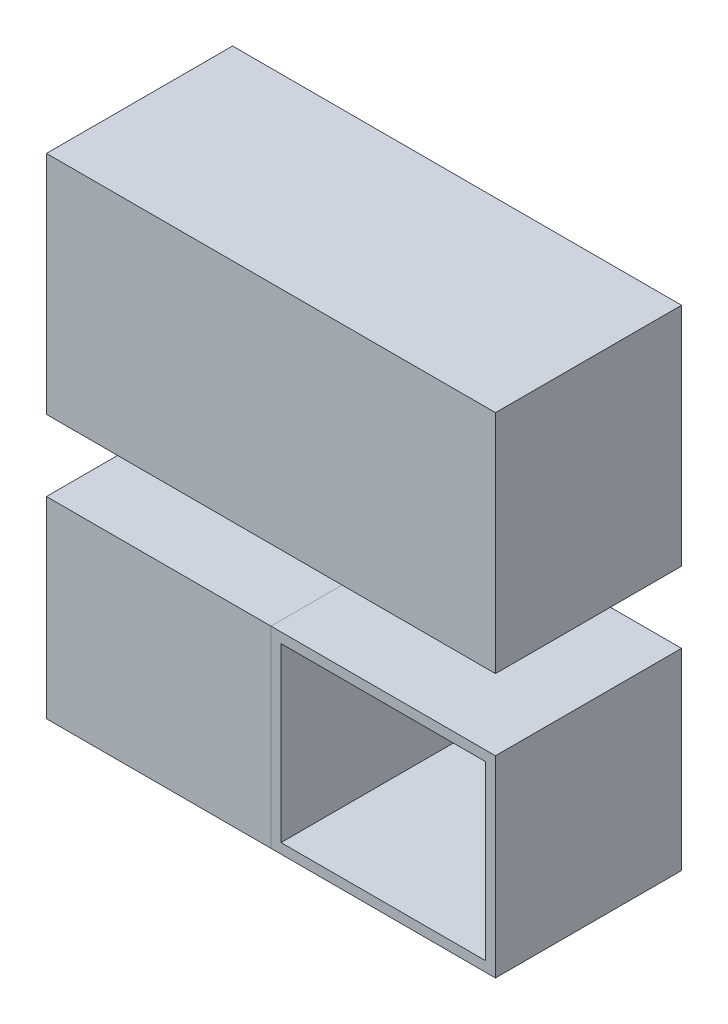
ISO-10303-21;
HEADER;
FILE_DESCRIPTION(('STEP AP214'),'2;1');
FILE_NAME('part.step','',(''),(''),'','','');
FILE_SCHEMA(('AUTOMOTIVE_DESIGN { 1 0 10303 214 1 1 1 1 }'));
ENDSEC;
DATA;
#1=APPLICATION_CONTEXT('core data for automotive mechanical design processes');
#2=APPLICATION_PROTOCOL_DEFINITION('international standard','automotive_design',2000,#1);
#3=PRODUCT_CONTEXT('',#1,'mechanical');
#4=PRODUCT('Part','Part','',(#3));
#5=PRODUCT_RELATED_PRODUCT_CATEGORY('part','',(#4));
#6=PRODUCT_DEFINITION_FORMATION('','',#4);
#7=PRODUCT_DEFINITION_CONTEXT('part definition',#1,'design');
#8=PRODUCT_DEFINITION('design','',#6,#7);
#9=PRODUCT_DEFINITION_SHAPE('','',#8);
#10=(LENGTH_UNIT() NAMED_UNIT(*) SI_UNIT(.MILLI.,.METRE.));
#11=(NAMED_UNIT(*) PLANE_ANGLE_UNIT() SI_UNIT($,.RADIAN.));
#12=(NAMED_UNIT(*) SI_UNIT($,.STERADIAN.) SOLID_ANGLE_UNIT());
#13=UNCERTAINTY_MEASURE_WITH_UNIT(LENGTH_MEASURE(1.E-05),#10,'distance_accuracy_value','');
#14=(GEOMETRIC_REPRESENTATION_CONTEXT(3) GLOBAL_UNCERTAINTY_ASSIGNED_CONTEXT((#13)) GLOBAL_UNIT_ASSIGNED_CONTEXT((#10,
#11,#12)) REPRESENTATION_CONTEXT('',''));
#15=CARTESIAN_POINT('',(0.,0.,0.));
#16=DIRECTION('',(0.,0.,1.));
#17=DIRECTION('',(1.,0.,0.));
#18=AXIS2_PLACEMENT_3D('',#15,#16,#17);
#19=CARTESIAN_POINT('',(56.7002958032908,-17.9628969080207,0.));
#20=DIRECTION('',(0.,0.,-1.));
#21=DIRECTION('',(-1.,0.,0.));
#22=AXIS2_PLACEMENT_3D('',#19,#20,#21);
#23=PLANE('',#22);
#24=DIRECTION('',(0.,-1.,0.));
#25=VECTOR('',#24,1.);
#26=CARTESIAN_POINT('',(56.7002958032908,-66.5730790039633,0.));
#27=LINE('',#26,#25);
#28=CARTESIAN_POINT('',(56.7002958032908,-17.9628969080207,0.));
#29=VERTEX_POINT('',#28);
#30=CARTESIAN_POINT('',(56.7002958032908,-66.5730790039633,0.));
#31=VERTEX_POINT('',#30);
#32=EDGE_CURVE('E114',#29,#31,#27,.T.);
#33=ORIENTED_EDGE('',*,*,#32,.T.);
#34=DIRECTION('',(1.,0.,0.));
#35=VECTOR('',#34,1.);
#36=CARTESIAN_POINT('',(56.7002958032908,-66.5730790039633,0.));
#37=LINE('',#36,#35);
#38=CARTESIAN_POINT('',(113.400591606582,-66.5730790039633,0.));
#39=VERTEX_POINT('',#38);
#40=EDGE_CURVE('E147',#31,#39,#37,.T.);
#41=ORIENTED_EDGE('',*,*,#40,.T.);
#42=DIRECTION('',(0.,1.,0.));
#43=VECTOR('',#42,1.);
#44=CARTESIAN_POINT('',(113.400591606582,-66.5730790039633,0.));
#45=LINE('',#44,#43);
#46=CARTESIAN_POINT('',(113.400591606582,-17.9628969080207,0.));
#47=VERTEX_POINT('',#46);
#48=EDGE_CURVE('E150',#39,#47,#45,.T.);
#49=ORIENTED_EDGE('',*,*,#48,.T.);
#50=DIRECTION('',(-1.,0.,0.));
#51=VECTOR('',#50,1.);
#52=CARTESIAN_POINT('',(56.7002958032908,-17.9628969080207,0.));
#53=LINE('',#52,#51);
#54=EDGE_CURVE('E153',#47,#29,#53,.T.);
#55=ORIENTED_EDGE('',*,*,#54,.T.);
#56=EDGE_LOOP('',(#33,#41,#49,#55));
#57=FACE_BOUND('',#56,.T.);
#58=DIRECTION('',(0.,-1.,0.));
#59=VECTOR('',#58,1.);
#60=CARTESIAN_POINT('',(59.2402958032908,-66.5730790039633,0.));
#61=LINE('',#60,#59);
#62=CARTESIAN_POINT('',(59.2402958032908,-20.5028969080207,0.));
#63=VERTEX_POINT('',#62);
#64=CARTESIAN_POINT('',(59.2402958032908,-64.0330790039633,0.));
#65=VERTEX_POINT('',#64);
#66=EDGE_CURVE('E138',#63,#65,#61,.T.);
#67=ORIENTED_EDGE('',*,*,#66,.F.);
#68=DIRECTION('',(-1.,0.,0.));
#69=VECTOR('',#68,1.);
#70=CARTESIAN_POINT('',(56.7002958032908,-20.5028969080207,0.));
#71=LINE('',#70,#69);
#72=CARTESIAN_POINT('',(110.860591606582,-20.5028969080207,0.));
#73=VERTEX_POINT('',#72);
#74=EDGE_CURVE('E110',#73,#63,#71,.T.);
#75=ORIENTED_EDGE('',*,*,#74,.F.);
#76=DIRECTION('',(0.,1.,0.));
#77=VECTOR('',#76,1.);
#78=CARTESIAN_POINT('',(110.860591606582,-66.5730790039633,0.));
#79=LINE('',#78,#77);
#80=CARTESIAN_POINT('',(110.860591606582,-64.0330790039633,0.));
#81=VERTEX_POINT('',#80);
#82=EDGE_CURVE('E55',#81,#73,#79,.T.);
#83=ORIENTED_EDGE('',*,*,#82,.F.);
#84=DIRECTION('',(1.,0.,0.));
#85=VECTOR('',#84,1.);
#86=CARTESIAN_POINT('',(56.7002958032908,-64.0330790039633,0.));
#87=LINE('',#86,#85);
#88=EDGE_CURVE('E140',#65,#81,#87,.T.);
#89=ORIENTED_EDGE('',*,*,#88,.F.);
#90=EDGE_LOOP('',(#67,#75,#83,#89));
#91=FACE_BOUND('',#90,.T.);
#92=ADVANCED_FACE('F38',(#57,#91),#23,.F.);
#93=CARTESIAN_POINT('',(56.7002958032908,-66.5730790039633,-46.99));
#94=DIRECTION('',(-1.,0.,0.));
#95=DIRECTION('',(0.,0.,1.));
#96=AXIS2_PLACEMENT_3D('',#93,#94,#95);
#97=PLANE('',#96);
#98=ORIENTED_EDGE('',*,*,#32,.F.);
#99=DIRECTION('',(0.,0.,1.));
#100=VECTOR('',#99,1.);
#101=CARTESIAN_POINT('',(56.7002958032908,-17.9628969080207,-46.99));
#102=LINE('',#101,#100);
#103=CARTESIAN_POINT('',(56.7002958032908,-17.9628969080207,-46.99));
#104=VERTEX_POINT('',#103);
#105=EDGE_CURVE('E12',#104,#29,#102,.T.);
#106=ORIENTED_EDGE('',*,*,#105,.F.);
#107=DIRECTION('',(0.,-1.,0.));
#108=VECTOR('',#107,1.);
#109=CARTESIAN_POINT('',(56.7002958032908,-66.5730790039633,-46.99));
#110=LINE('',#109,#108);
#111=CARTESIAN_POINT('',(56.7002958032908,-66.5730790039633,-46.99));
#112=VERTEX_POINT('',#111);
#113=EDGE_CURVE('E156',#104,#112,#110,.T.);
#114=ORIENTED_EDGE('',*,*,#113,.T.);
#115=DIRECTION('',(0.,0.,1.));
#116=VECTOR('',#115,1.);
#117=CARTESIAN_POINT('',(56.7002958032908,-66.5730790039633,-46.99));
#118=LINE('',#117,#116);
#119=EDGE_CURVE('E42',#112,#31,#118,.T.);
#120=ORIENTED_EDGE('',*,*,#119,.T.);
#121=EDGE_LOOP('',(#98,#106,#114,#120));
#122=FACE_BOUND('',#121,.T.);
#123=ADVANCED_FACE('F40',(#122),#97,.T.);
#124=CARTESIAN_POINT('',(56.7002958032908,-17.9628969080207,-46.99));
#125=DIRECTION('',(0.,1.,0.));
#126=DIRECTION('',(0.,0.,1.));
#127=AXIS2_PLACEMENT_3D('',#124,#125,#126);
#128=PLANE('',#127);
#129=ORIENTED_EDGE('',*,*,#54,.F.);
#130=DIRECTION('',(0.,0.,1.));
#131=VECTOR('',#130,1.);
#132=CARTESIAN_POINT('',(113.400591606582,-17.9628969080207,-46.99));
#133=LINE('',#132,#131);
#134=CARTESIAN_POINT('',(113.400591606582,-17.9628969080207,-46.99));
#135=VERTEX_POINT('',#134);
#136=EDGE_CURVE('E47',#135,#47,#133,.T.);
#137=ORIENTED_EDGE('',*,*,#136,.F.);
#138=DIRECTION('',(-1.,0.,0.));
#139=VECTOR('',#138,1.);
#140=CARTESIAN_POINT('',(56.7002958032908,-17.9628969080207,-46.99));
#141=LINE('',#140,#139);
#142=EDGE_CURVE('E164',#135,#104,#141,.T.);
#143=ORIENTED_EDGE('',*,*,#142,.T.);
#144=ORIENTED_EDGE('',*,*,#105,.T.);
#145=EDGE_LOOP('',(#129,#137,#143,#144));
#146=FACE_BOUND('',#145,.T.);
#147=ADVANCED_FACE('F177',(#146),#128,.T.);
#148=CARTESIAN_POINT('',(113.400591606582,-66.5730790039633,-46.99));
#149=DIRECTION('',(1.,0.,0.));
#150=DIRECTION('',(0.,0.,-1.));
#151=AXIS2_PLACEMENT_3D('',#148,#149,#150);
#152=PLANE('',#151);
#153=ORIENTED_EDGE('',*,*,#48,.F.);
#154=DIRECTION('',(0.,0.,1.));
#155=VECTOR('',#154,1.);
#156=CARTESIAN_POINT('',(113.400591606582,-66.5730790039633,-46.99));
#157=LINE('',#156,#155);
#158=CARTESIAN_POINT('',(113.400591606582,-66.5730790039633,-46.99));
#159=VERTEX_POINT('',#158);
#160=EDGE_CURVE('E167',#159,#39,#157,.T.);
#161=ORIENTED_EDGE('',*,*,#160,.F.);
#162=DIRECTION('',(0.,1.,0.));
#163=VECTOR('',#162,1.);
#164=CARTESIAN_POINT('',(113.400591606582,-66.5730790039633,-46.99));
#165=LINE('',#164,#163);
#166=EDGE_CURVE('E161',#159,#135,#165,.T.);
#167=ORIENTED_EDGE('',*,*,#166,.T.);
#168=ORIENTED_EDGE('',*,*,#136,.T.);
#169=EDGE_LOOP('',(#153,#161,#167,#168));
#170=FACE_BOUND('',#169,.T.);
#171=ADVANCED_FACE('F183',(#170),#152,.T.);
#172=CARTESIAN_POINT('',(56.7002958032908,-66.5730790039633,-46.99));
#173=DIRECTION('',(0.,-1.,0.));
#174=DIRECTION('',(0.,0.,-1.));
#175=AXIS2_PLACEMENT_3D('',#172,#173,#174);
#176=PLANE('',#175);
#177=ORIENTED_EDGE('',*,*,#40,.F.);
#178=ORIENTED_EDGE('',*,*,#119,.F.);
#179=DIRECTION('',(1.,0.,0.));
#180=VECTOR('',#179,1.);
#181=CARTESIAN_POINT('',(56.7002958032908,-66.5730790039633,-46.99));
#182=LINE('',#181,#180);
#183=EDGE_CURVE('E158',#112,#159,#182,.T.);
#184=ORIENTED_EDGE('',*,*,#183,.T.);
#185=ORIENTED_EDGE('',*,*,#160,.T.);
#186=EDGE_LOOP('',(#177,#178,#184,#185));
#187=FACE_BOUND('',#186,.T.);
#188=ADVANCED_FACE('F172',(#187),#176,.T.);
#189=CARTESIAN_POINT('',(56.7002958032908,-17.9628969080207,-46.99));
#190=DIRECTION('',(0.,0.,-1.));
#191=DIRECTION('',(-1.,0.,0.));
#192=AXIS2_PLACEMENT_3D('',#189,#190,#191);
#193=PLANE('',#192);
#194=ORIENTED_EDGE('',*,*,#113,.F.);
#195=ORIENTED_EDGE('',*,*,#142,.F.);
#196=ORIENTED_EDGE('',*,*,#166,.F.);
#197=ORIENTED_EDGE('',*,*,#183,.F.);
#198=EDGE_LOOP('',(#194,#195,#196,#197));
#199=FACE_BOUND('',#198,.T.);
#200=ADVANCED_FACE('F181',(#199),#193,.T.);
#201=CARTESIAN_POINT('',(59.2402958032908,-66.5730790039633,-46.99));
#202=DIRECTION('',(-1.,0.,0.));
#203=DIRECTION('',(0.,0.,1.));
#204=AXIS2_PLACEMENT_3D('',#201,#202,#203);
#205=PLANE('',#204);
#206=ORIENTED_EDGE('',*,*,#66,.T.);
#207=DIRECTION('',(0.,0.,1.));
#208=VECTOR('',#207,1.);
#209=CARTESIAN_POINT('',(59.2402958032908,-64.0330790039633,-46.99));
#210=LINE('',#209,#208);
#211=CARTESIAN_POINT('',(59.2402958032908,-64.0330790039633,-44.45));
#212=VERTEX_POINT('',#211);
#213=EDGE_CURVE('E120',#212,#65,#210,.T.);
#214=ORIENTED_EDGE('',*,*,#213,.F.);
#215=DIRECTION('',(0.,-1.,0.));
#216=VECTOR('',#215,1.);
#217=CARTESIAN_POINT('',(59.2402958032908,-66.5730790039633,-44.45));
#218=LINE('',#217,#216);
#219=CARTESIAN_POINT('',(59.2402958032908,-20.5028969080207,-44.45));
#220=VERTEX_POINT('',#219);
#221=EDGE_CURVE('E118',#220,#212,#218,.T.);
#222=ORIENTED_EDGE('',*,*,#221,.F.);
#223=DIRECTION('',(0.,0.,1.));
#224=VECTOR('',#223,1.);
#225=CARTESIAN_POINT('',(59.2402958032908,-20.5028969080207,-46.99));
#226=LINE('',#225,#224);
#227=EDGE_CURVE('E104',#220,#63,#226,.T.);
#228=ORIENTED_EDGE('',*,*,#227,.T.);
#229=EDGE_LOOP('',(#206,#214,#222,#228));
#230=FACE_BOUND('',#229,.T.);
#231=ADVANCED_FACE('F119',(#230),#205,.F.);
#232=CARTESIAN_POINT('',(56.7002958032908,-20.5028969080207,-46.99));
#233=DIRECTION('',(0.,1.,0.));
#234=DIRECTION('',(0.,0.,1.));
#235=AXIS2_PLACEMENT_3D('',#232,#233,#234);
#236=PLANE('',#235);
#237=ORIENTED_EDGE('',*,*,#74,.T.);
#238=ORIENTED_EDGE('',*,*,#227,.F.);
#239=DIRECTION('',(-1.,0.,0.));
#240=VECTOR('',#239,1.);
#241=CARTESIAN_POINT('',(56.7002958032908,-20.5028969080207,-44.45));
#242=LINE('',#241,#240);
#243=CARTESIAN_POINT('',(110.860591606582,-20.5028969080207,-44.45));
#244=VERTEX_POINT('',#243);
#245=EDGE_CURVE('E108',#244,#220,#242,.T.);
#246=ORIENTED_EDGE('',*,*,#245,.F.);
#247=DIRECTION('',(0.,0.,1.));
#248=VECTOR('',#247,1.);
#249=CARTESIAN_POINT('',(110.860591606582,-20.5028969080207,-46.99));
#250=LINE('',#249,#248);
#251=EDGE_CURVE('E115',#244,#73,#250,.T.);
#252=ORIENTED_EDGE('',*,*,#251,.T.);
#253=EDGE_LOOP('',(#237,#238,#246,#252));
#254=FACE_BOUND('',#253,.T.);
#255=ADVANCED_FACE('F106',(#254),#236,.F.);
#256=CARTESIAN_POINT('',(110.860591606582,-66.5730790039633,-46.99));
#257=DIRECTION('',(1.,0.,0.));
#258=DIRECTION('',(0.,0.,-1.));
#259=AXIS2_PLACEMENT_3D('',#256,#257,#258);
#260=PLANE('',#259);
#261=ORIENTED_EDGE('',*,*,#82,.T.);
#262=ORIENTED_EDGE('',*,*,#251,.F.);
#263=DIRECTION('',(0.,1.,0.));
#264=VECTOR('',#263,1.);
#265=CARTESIAN_POINT('',(110.860591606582,-66.5730790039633,-44.45));
#266=LINE('',#265,#264);
#267=CARTESIAN_POINT('',(110.860591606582,-64.0330790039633,-44.45));
#268=VERTEX_POINT('',#267);
#269=EDGE_CURVE('E129',#268,#244,#266,.T.);
#270=ORIENTED_EDGE('',*,*,#269,.F.);
#271=DIRECTION('',(0.,0.,1.));
#272=VECTOR('',#271,1.);
#273=CARTESIAN_POINT('',(110.860591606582,-64.0330790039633,-46.99));
#274=LINE('',#273,#272);
#275=EDGE_CURVE('E131',#268,#81,#274,.T.);
#276=ORIENTED_EDGE('',*,*,#275,.T.);
#277=EDGE_LOOP('',(#261,#262,#270,#276));
#278=FACE_BOUND('',#277,.T.);
#279=ADVANCED_FACE('F207',(#278),#260,.F.);
#280=CARTESIAN_POINT('',(56.7002958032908,-64.0330790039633,-46.99));
#281=DIRECTION('',(0.,-1.,0.));
#282=DIRECTION('',(0.,0.,-1.));
#283=AXIS2_PLACEMENT_3D('',#280,#281,#282);
#284=PLANE('',#283);
#285=ORIENTED_EDGE('',*,*,#88,.T.);
#286=ORIENTED_EDGE('',*,*,#275,.F.);
#287=DIRECTION('',(1.,0.,0.));
#288=VECTOR('',#287,1.);
#289=CARTESIAN_POINT('',(56.7002958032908,-64.0330790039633,-44.45));
#290=LINE('',#289,#288);
#291=EDGE_CURVE('E124',#212,#268,#290,.T.);
#292=ORIENTED_EDGE('',*,*,#291,.F.);
#293=ORIENTED_EDGE('',*,*,#213,.T.);
#294=EDGE_LOOP('',(#285,#286,#292,#293));
#295=FACE_BOUND('',#294,.T.);
#296=ADVANCED_FACE('F211',(#295),#284,.F.);
#297=CARTESIAN_POINT('',(56.7002958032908,-17.9628969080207,-44.45));
#298=DIRECTION('',(0.,0.,-1.));
#299=DIRECTION('',(-1.,0.,0.));
#300=AXIS2_PLACEMENT_3D('',#297,#298,#299);
#301=PLANE('',#300);
#302=ORIENTED_EDGE('',*,*,#221,.T.);
#303=ORIENTED_EDGE('',*,*,#291,.T.);
#304=ORIENTED_EDGE('',*,*,#269,.T.);
#305=ORIENTED_EDGE('',*,*,#245,.T.);
#306=EDGE_LOOP('',(#302,#303,#304,#305));
#307=FACE_BOUND('',#306,.T.);
#308=ADVANCED_FACE('F127',(#307),#301,.F.);
#309=CLOSED_SHELL('',(#92,#123,#147,#171,#188,#200,#231,#255,#279,#296,#308));
#310=MANIFOLD_SOLID_BREP('B2',#309);
#311=CARTESIAN_POINT('',(0.,-17.9628969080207,-46.99));
#312=DIRECTION('',(-1.,0.,0.));
#313=DIRECTION('',(0.,0.,1.));
#314=AXIS2_PLACEMENT_3D('',#311,#312,#313);
#315=PLANE('',#314);
#316=DIRECTION('',(0.,-1.,0.));
#317=VECTOR('',#316,1.);
#318=CARTESIAN_POINT('',(0.,-17.9628969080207,0.));
#319=LINE('',#318,#317);
#320=CARTESIAN_POINT('',(0.,-17.9628969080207,0.));
#321=VERTEX_POINT('',#320);
#322=CARTESIAN_POINT('',(0.,-66.5730790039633,0.));
#323=VERTEX_POINT('',#322);
#324=EDGE_CURVE('E303',#321,#323,#319,.T.);
#325=ORIENTED_EDGE('',*,*,#324,.F.);
#326=DIRECTION('',(0.,0.,1.));
#327=VECTOR('',#326,1.);
#328=CARTESIAN_POINT('',(0.,-17.9628969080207,-46.99));
#329=LINE('',#328,#327);
#330=CARTESIAN_POINT('',(0.,-17.9628969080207,-46.99));
#331=VERTEX_POINT('',#330);
#332=EDGE_CURVE('E36',#331,#321,#329,.T.);
#333=ORIENTED_EDGE('',*,*,#332,.F.);
#334=DIRECTION('',(0.,-1.,0.));
#335=VECTOR('',#334,1.);
#336=CARTESIAN_POINT('',(0.,-17.9628969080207,-46.99));
#337=LINE('',#336,#335);
#338=CARTESIAN_POINT('',(0.,-66.5730790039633,-46.99));
#339=VERTEX_POINT('',#338);
#340=EDGE_CURVE('E305',#331,#339,#337,.T.);
#341=ORIENTED_EDGE('',*,*,#340,.T.);
#342=DIRECTION('',(0.,0.,1.));
#343=VECTOR('',#342,1.);
#344=CARTESIAN_POINT('',(0.,-66.5730790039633,-46.99));
#345=LINE('',#344,#343);
#346=EDGE_CURVE('E266',#339,#323,#345,.T.);
#347=ORIENTED_EDGE('',*,*,#346,.T.);
#348=EDGE_LOOP('',(#325,#333,#341,#347));
#349=FACE_BOUND('',#348,.T.);
#350=ADVANCED_FACE('F263',(#349),#315,.T.);
#351=CARTESIAN_POINT('',(0.,-17.9628969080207,-46.99));
#352=DIRECTION('',(0.,1.,0.));
#353=DIRECTION('',(0.,0.,1.));
#354=AXIS2_PLACEMENT_3D('',#351,#352,#353);
#355=PLANE('',#354);
#356=DIRECTION('',(-1.,0.,0.));
#357=VECTOR('',#356,1.);
#358=CARTESIAN_POINT('',(0.,-17.9628969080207,0.));
#359=LINE('',#358,#357);
#360=CARTESIAN_POINT('',(56.7002958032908,-17.9628969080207,0.));
#361=VERTEX_POINT('',#360);
#362=EDGE_CURVE('E320',#361,#321,#359,.T.);
#363=ORIENTED_EDGE('',*,*,#362,.F.);
#364=DIRECTION('',(0.,0.,1.));
#365=VECTOR('',#364,1.);
#366=CARTESIAN_POINT('',(56.7002958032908,-17.9628969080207,-46.99));
#367=LINE('',#366,#365);
#368=CARTESIAN_POINT('',(56.7002958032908,-17.9628969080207,-46.99));
#369=VERTEX_POINT('',#368);
#370=EDGE_CURVE('E271',#369,#361,#367,.T.);
#371=ORIENTED_EDGE('',*,*,#370,.F.);
#372=DIRECTION('',(-1.,0.,0.));
#373=VECTOR('',#372,1.);
#374=CARTESIAN_POINT('',(0.,-17.9628969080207,-46.99));
#375=LINE('',#374,#373);
#376=EDGE_CURVE('E310',#369,#331,#375,.T.);
#377=ORIENTED_EDGE('',*,*,#376,.T.);
#378=ORIENTED_EDGE('',*,*,#332,.T.);
#379=EDGE_LOOP('',(#363,#371,#377,#378));
#380=FACE_BOUND('',#379,.T.);
#381=ADVANCED_FACE('F335',(#380),#355,.T.);
#382=CARTESIAN_POINT('',(56.7002958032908,-17.9628969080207,-46.99));
#383=DIRECTION('',(1.,0.,0.));
#384=DIRECTION('',(0.,0.,-1.));
#385=AXIS2_PLACEMENT_3D('',#382,#383,#384);
#386=PLANE('',#385);
#387=DIRECTION('',(0.,1.,0.));
#388=VECTOR('',#387,1.);
#389=CARTESIAN_POINT('',(56.7002958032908,-17.9628969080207,0.));
#390=LINE('',#389,#388);
#391=CARTESIAN_POINT('',(56.7002958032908,-66.5730790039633,0.));
#392=VERTEX_POINT('',#391);
#393=EDGE_CURVE('E317',#392,#361,#390,.T.);
#394=ORIENTED_EDGE('',*,*,#393,.F.);
#395=DIRECTION('',(0.,0.,1.));
#396=VECTOR('',#395,1.);
#397=CARTESIAN_POINT('',(56.7002958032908,-66.5730790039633,-46.99));
#398=LINE('',#397,#396);
#399=CARTESIAN_POINT('',(56.7002958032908,-66.5730790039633,-46.99));
#400=VERTEX_POINT('',#399);
#401=EDGE_CURVE('E309',#400,#392,#398,.T.);
#402=ORIENTED_EDGE('',*,*,#401,.F.);
#403=DIRECTION('',(0.,1.,0.));
#404=VECTOR('',#403,1.);
#405=CARTESIAN_POINT('',(56.7002958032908,-17.9628969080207,-46.99));
#406=LINE('',#405,#404);
#407=EDGE_CURVE('E328',#400,#369,#406,.T.);
#408=ORIENTED_EDGE('',*,*,#407,.T.);
#409=ORIENTED_EDGE('',*,*,#370,.T.);
#410=EDGE_LOOP('',(#394,#402,#408,#409));
#411=FACE_BOUND('',#410,.T.);
#412=ADVANCED_FACE('F332',(#411),#386,.T.);
#413=CARTESIAN_POINT('',(0.,-66.5730790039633,-46.99));
#414=DIRECTION('',(0.,-1.,0.));
#415=DIRECTION('',(0.,0.,-1.));
#416=AXIS2_PLACEMENT_3D('',#413,#414,#415);
#417=PLANE('',#416);
#418=DIRECTION('',(1.,0.,0.));
#419=VECTOR('',#418,1.);
#420=CARTESIAN_POINT('',(0.,-66.5730790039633,0.));
#421=LINE('',#420,#419);
#422=EDGE_CURVE('E312',#323,#392,#421,.T.);
#423=ORIENTED_EDGE('',*,*,#422,.F.);
#424=ORIENTED_EDGE('',*,*,#346,.F.);
#425=DIRECTION('',(1.,0.,0.));
#426=VECTOR('',#425,1.);
#427=CARTESIAN_POINT('',(0.,-66.5730790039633,-46.99));
#428=LINE('',#427,#426);
#429=EDGE_CURVE('E326',#339,#400,#428,.T.);
#430=ORIENTED_EDGE('',*,*,#429,.T.);
#431=ORIENTED_EDGE('',*,*,#401,.T.);
#432=EDGE_LOOP('',(#423,#424,#430,#431));
#433=FACE_BOUND('',#432,.T.);
#434=ADVANCED_FACE('F313',(#433),#417,.T.);
#435=CARTESIAN_POINT('',(0.,-66.5730790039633,-46.99));
#436=DIRECTION('',(0.,0.,1.));
#437=DIRECTION('',(1.,0.,0.));
#438=AXIS2_PLACEMENT_3D('',#435,#436,#437);
#439=PLANE('',#438);
#440=ORIENTED_EDGE('',*,*,#340,.F.);
#441=ORIENTED_EDGE('',*,*,#376,.F.);
#442=ORIENTED_EDGE('',*,*,#407,.F.);
#443=ORIENTED_EDGE('',*,*,#429,.F.);
#444=EDGE_LOOP('',(#440,#441,#442,#443));
#445=FACE_BOUND('',#444,.T.);
#446=ADVANCED_FACE('F337',(#445),#439,.F.);
#447=CARTESIAN_POINT('',(0.,-66.5730790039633,0.));
#448=DIRECTION('',(0.,0.,1.));
#449=DIRECTION('',(1.,0.,0.));
#450=AXIS2_PLACEMENT_3D('',#447,#448,#449);
#451=PLANE('',#450);
#452=ORIENTED_EDGE('',*,*,#324,.T.);
#453=ORIENTED_EDGE('',*,*,#422,.T.);
#454=ORIENTED_EDGE('',*,*,#393,.T.);
#455=ORIENTED_EDGE('',*,*,#362,.T.);
#456=EDGE_LOOP('',(#452,#453,#454,#455));
#457=FACE_BOUND('',#456,.T.);
#458=ADVANCED_FACE('F319',(#457),#451,.T.);
#459=CLOSED_SHELL('',(#350,#381,#412,#434,#446,#458));
#460=MANIFOLD_SOLID_BREP('B6',#459);
#461=CARTESIAN_POINT('',(0.,0.,-46.99));
#462=DIRECTION('',(-1.,0.,0.));
#463=DIRECTION('',(0.,0.,1.));
#464=AXIS2_PLACEMENT_3D('',#461,#462,#463);
#465=PLANE('',#464);
#466=DIRECTION('',(0.,-1.,0.));
#467=VECTOR('',#466,1.);
#468=CARTESIAN_POINT('',(0.,0.,0.));
#469=LINE('',#468,#467);
#470=CARTESIAN_POINT('',(0.,57.0816879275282,0.));
#471=VERTEX_POINT('',#470);
#472=CARTESIAN_POINT('',(0.,0.,0.));
#473=VERTEX_POINT('',#472);
#474=EDGE_CURVE('E414',#471,#473,#469,.T.);
#475=ORIENTED_EDGE('',*,*,#474,.F.);
#476=DIRECTION('',(0.,0.,1.));
#477=VECTOR('',#476,1.);
#478=CARTESIAN_POINT('',(0.,57.0816879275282,-46.99));
#479=LINE('',#478,#477);
#480=CARTESIAN_POINT('',(0.,57.0816879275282,-46.99));
#481=VERTEX_POINT('',#480);
#482=EDGE_CURVE('E261',#481,#471,#479,.T.);
#483=ORIENTED_EDGE('',*,*,#482,.F.);
#484=DIRECTION('',(0.,-1.,0.));
#485=VECTOR('',#484,1.);
#486=CARTESIAN_POINT('',(0.,0.,-46.99));
#487=LINE('',#486,#485);
#488=CARTESIAN_POINT('',(0.,0.,-46.99));
#489=VERTEX_POINT('',#488);
#490=EDGE_CURVE('E416',#481,#489,#487,.T.);
#491=ORIENTED_EDGE('',*,*,#490,.T.);
#492=DIRECTION('',(0.,0.,1.));
#493=VECTOR('',#492,1.);
#494=CARTESIAN_POINT('',(0.,0.,-46.99));
#495=LINE('',#494,#493);
#496=EDGE_CURVE('E377',#489,#473,#495,.T.);
#497=ORIENTED_EDGE('',*,*,#496,.T.);
#498=EDGE_LOOP('',(#475,#483,#491,#497));
#499=FACE_BOUND('',#498,.T.);
#500=ADVANCED_FACE('F374',(#499),#465,.T.);
#501=CARTESIAN_POINT('',(0.,57.0816879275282,-46.99));
#502=DIRECTION('',(0.,1.,0.));
#503=DIRECTION('',(0.,0.,1.));
#504=AXIS2_PLACEMENT_3D('',#501,#502,#503);
#505=PLANE('',#504);
#506=DIRECTION('',(-1.,0.,0.));
#507=VECTOR('',#506,1.);
#508=CARTESIAN_POINT('',(0.,57.0816879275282,0.));
#509=LINE('',#508,#507);
#510=CARTESIAN_POINT('',(113.400591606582,57.0816879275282,0.));
#511=VERTEX_POINT('',#510);
#512=EDGE_CURVE('E431',#511,#471,#509,.T.);
#513=ORIENTED_EDGE('',*,*,#512,.F.);
#514=DIRECTION('',(0.,0.,1.));
#515=VECTOR('',#514,1.);
#516=CARTESIAN_POINT('',(113.400591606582,57.0816879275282,-46.99));
#517=LINE('',#516,#515);
#518=CARTESIAN_POINT('',(113.400591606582,57.0816879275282,-46.99));
#519=VERTEX_POINT('',#518);
#520=EDGE_CURVE('E382',#519,#511,#517,.T.);
#521=ORIENTED_EDGE('',*,*,#520,.F.);
#522=DIRECTION('',(-1.,0.,0.));
#523=VECTOR('',#522,1.);
#524=CARTESIAN_POINT('',(0.,57.0816879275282,-46.99));
#525=LINE('',#524,#523);
#526=EDGE_CURVE('E421',#519,#481,#525,.T.);
#527=ORIENTED_EDGE('',*,*,#526,.T.);
#528=ORIENTED_EDGE('',*,*,#482,.T.);
#529=EDGE_LOOP('',(#513,#521,#527,#528));
#530=FACE_BOUND('',#529,.T.);
#531=ADVANCED_FACE('F446',(#530),#505,.T.);
#532=CARTESIAN_POINT('',(113.400591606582,0.,-46.99));
#533=DIRECTION('',(1.,0.,0.));
#534=DIRECTION('',(0.,0.,-1.));
#535=AXIS2_PLACEMENT_3D('',#532,#533,#534);
#536=PLANE('',#535);
#537=DIRECTION('',(0.,1.,0.));
#538=VECTOR('',#537,1.);
#539=CARTESIAN_POINT('',(113.400591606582,0.,0.));
#540=LINE('',#539,#538);
#541=CARTESIAN_POINT('',(113.400591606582,0.,0.));
#542=VERTEX_POINT('',#541);
#543=EDGE_CURVE('E428',#542,#511,#540,.T.);
#544=ORIENTED_EDGE('',*,*,#543,.F.);
#545=DIRECTION('',(0.,0.,1.));
#546=VECTOR('',#545,1.);
#547=CARTESIAN_POINT('',(113.400591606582,0.,-46.99));
#548=LINE('',#547,#546);
#549=CARTESIAN_POINT('',(113.400591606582,0.,-46.99));
#550=VERTEX_POINT('',#549);
#551=EDGE_CURVE('E420',#550,#542,#548,.T.);
#552=ORIENTED_EDGE('',*,*,#551,.F.);
#553=DIRECTION('',(0.,1.,0.));
#554=VECTOR('',#553,1.);
#555=CARTESIAN_POINT('',(113.400591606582,0.,-46.99));
#556=LINE('',#555,#554);
#557=EDGE_CURVE('E439',#550,#519,#556,.T.);
#558=ORIENTED_EDGE('',*,*,#557,.T.);
#559=ORIENTED_EDGE('',*,*,#520,.T.);
#560=EDGE_LOOP('',(#544,#552,#558,#559));
#561=FACE_BOUND('',#560,.T.);
#562=ADVANCED_FACE('F443',(#561),#536,.T.);
#563=CARTESIAN_POINT('',(0.,0.,-46.99));
#564=DIRECTION('',(0.,-1.,0.));
#565=DIRECTION('',(0.,0.,-1.));
#566=AXIS2_PLACEMENT_3D('',#563,#564,#565);
#567=PLANE('',#566);
#568=DIRECTION('',(1.,0.,0.));
#569=VECTOR('',#568,1.);
#570=CARTESIAN_POINT('',(0.,0.,0.));
#571=LINE('',#570,#569);
#572=EDGE_CURVE('E423',#473,#542,#571,.T.);
#573=ORIENTED_EDGE('',*,*,#572,.F.);
#574=ORIENTED_EDGE('',*,*,#496,.F.);
#575=DIRECTION('',(1.,0.,0.));
#576=VECTOR('',#575,1.);
#577=CARTESIAN_POINT('',(0.,0.,-46.99));
#578=LINE('',#577,#576);
#579=EDGE_CURVE('E437',#489,#550,#578,.T.);
#580=ORIENTED_EDGE('',*,*,#579,.T.);
#581=ORIENTED_EDGE('',*,*,#551,.T.);
#582=EDGE_LOOP('',(#573,#574,#580,#581));
#583=FACE_BOUND('',#582,.T.);
#584=ADVANCED_FACE('F424',(#583),#567,.T.);
#585=CARTESIAN_POINT('',(0.,57.0816879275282,-46.99));
#586=DIRECTION('',(0.,0.,-1.));
#587=DIRECTION('',(-1.,0.,0.));
#588=AXIS2_PLACEMENT_3D('',#585,#586,#587);
#589=PLANE('',#588);
#590=ORIENTED_EDGE('',*,*,#490,.F.);
#591=ORIENTED_EDGE('',*,*,#526,.F.);
#592=ORIENTED_EDGE('',*,*,#557,.F.);
#593=ORIENTED_EDGE('',*,*,#579,.F.);
#594=EDGE_LOOP('',(#590,#591,#592,#593));
#595=FACE_BOUND('',#594,.T.);
#596=ADVANCED_FACE('F448',(#595),#589,.T.);
#597=CARTESIAN_POINT('',(0.,57.0816879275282,0.));
#598=DIRECTION('',(0.,0.,-1.));
#599=DIRECTION('',(-1.,0.,0.));
#600=AXIS2_PLACEMENT_3D('',#597,#598,#599);
#601=PLANE('',#600);
#602=ORIENTED_EDGE('',*,*,#474,.T.);
#603=ORIENTED_EDGE('',*,*,#572,.T.);
#604=ORIENTED_EDGE('',*,*,#543,.T.);
#605=ORIENTED_EDGE('',*,*,#512,.T.);
#606=EDGE_LOOP('',(#602,#603,#604,#605));
#607=FACE_BOUND('',#606,.T.);
#608=ADVANCED_FACE('F430',(#607),#601,.F.);
#609=CLOSED_SHELL('',(#500,#531,#562,#584,#596,#608));
#610=MANIFOLD_SOLID_BREP('B30',#609);
#611=ADVANCED_BREP_SHAPE_REPRESENTATION('',(#18,#310,#460,#610),#14);
#612=SHAPE_DEFINITION_REPRESENTATION(#9,#611);
ENDSEC;
END-ISO-10303-21;
